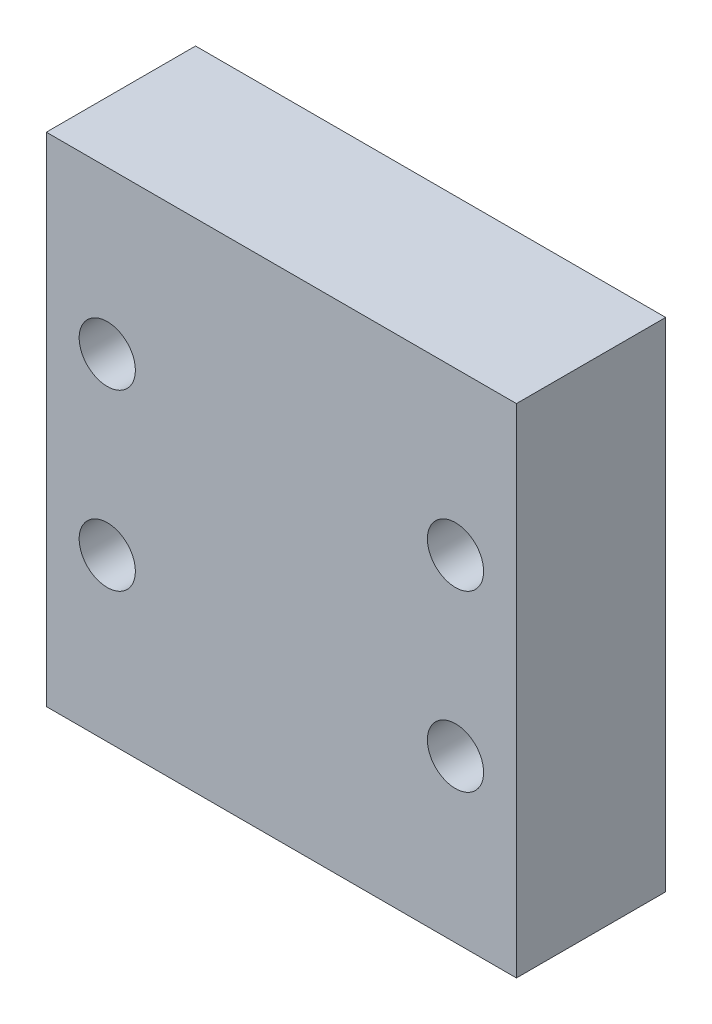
from build123d import *

# Parameters (mm, degrees)
SKETCH1_W           = 18.9
SKETCH1_H           = 20
SKETCH1_R           = 1.13
BOSS_EXTRUDE1_DEPTH = 6


with BuildPart() as part:
    # Sketch1 → Boss-Extrude1 (new body)
    with BuildSketch(Plane.XY):
        with Locations((9.45, 10)):
            Rectangle(SKETCH1_W, SKETCH1_H)
        with Locations((2.45, 6.5)):
            Circle(SKETCH1_R, mode=Mode.SUBTRACT)
        with Locations((2.45, 13.5)):
            Circle(SKETCH1_R, mode=Mode.SUBTRACT)
        with Locations((16.45, 13.5)):
            Circle(SKETCH1_R, mode=Mode.SUBTRACT)
        with Locations((16.45, 6.5)):
            Circle(SKETCH1_R, mode=Mode.SUBTRACT)
    extrude(amount=BOSS_EXTRUDE1_DEPTH)


solid = part.part
